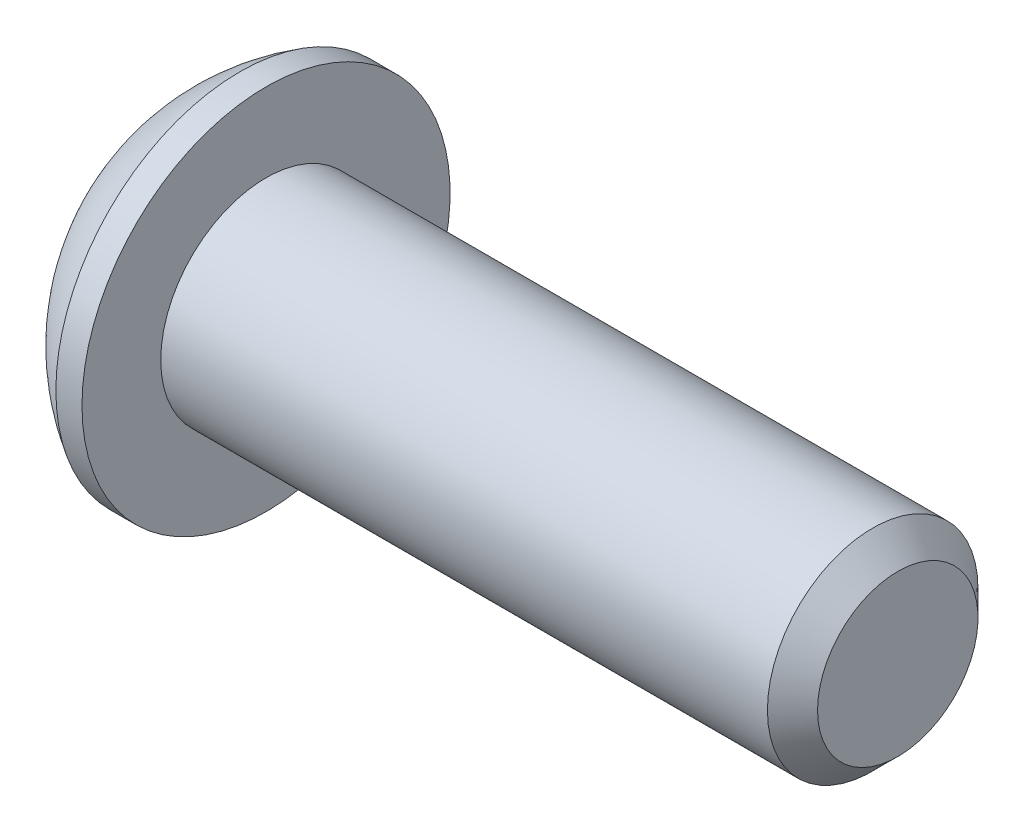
ISO-10303-21;
HEADER;
FILE_DESCRIPTION(('STEP AP214'),'2;1');
FILE_NAME('part.step','',(''),(''),'','','');
FILE_SCHEMA(('AUTOMOTIVE_DESIGN { 1 0 10303 214 1 1 1 1 }'));
ENDSEC;
DATA;
#1=APPLICATION_CONTEXT('core data for automotive mechanical design processes');
#2=APPLICATION_PROTOCOL_DEFINITION('international standard','automotive_design',2000,#1);
#3=PRODUCT_CONTEXT('',#1,'mechanical');
#4=PRODUCT('Part','Part','',(#3));
#5=PRODUCT_RELATED_PRODUCT_CATEGORY('part','',(#4));
#6=PRODUCT_DEFINITION_FORMATION('','',#4);
#7=PRODUCT_DEFINITION_CONTEXT('part definition',#1,'design');
#8=PRODUCT_DEFINITION('design','',#6,#7);
#9=PRODUCT_DEFINITION_SHAPE('','',#8);
#10=(LENGTH_UNIT() NAMED_UNIT(*) SI_UNIT(.MILLI.,.METRE.));
#11=(NAMED_UNIT(*) PLANE_ANGLE_UNIT() SI_UNIT($,.RADIAN.));
#12=(NAMED_UNIT(*) SI_UNIT($,.STERADIAN.) SOLID_ANGLE_UNIT());
#13=UNCERTAINTY_MEASURE_WITH_UNIT(LENGTH_MEASURE(1.E-05),#10,'distance_accuracy_value','');
#14=(GEOMETRIC_REPRESENTATION_CONTEXT(3) GLOBAL_UNCERTAINTY_ASSIGNED_CONTEXT((#13)) GLOBAL_UNIT_ASSIGNED_CONTEXT((#10,
#11,#12)) REPRESENTATION_CONTEXT('',''));
#15=CARTESIAN_POINT('',(0.,0.,0.));
#16=DIRECTION('',(0.,0.,1.));
#17=DIRECTION('',(1.,0.,0.));
#18=AXIS2_PLACEMENT_3D('',#15,#16,#17);
#19=CARTESIAN_POINT('',(0.,0.,0.));
#20=DIRECTION('',(-1.,0.,0.));
#21=DIRECTION('',(0.,0.,1.));
#22=AXIS2_PLACEMENT_3D('',#19,#20,#21);
#23=PLANE('',#22);
#24=CARTESIAN_POINT('',(0.,0.,0.));
#25=DIRECTION('',(-1.,0.,0.));
#26=DIRECTION('',(0.,0.,1.));
#27=AXIS2_PLACEMENT_3D('',#24,#25,#26);
#28=CIRCLE('',#27,2.77495);
#29=CARTESIAN_POINT('',(0.,2.77495,0.));
#30=VERTEX_POINT('',#29);
#31=EDGE_CURVE('E11',#30,#30,#28,.T.);
#32=ORIENTED_EDGE('',*,*,#31,.T.);
#33=EDGE_LOOP('',(#32));
#34=FACE_BOUND('',#33,.T.);
#35=DIRECTION('',(0.,-1.,0.));
#36=VECTOR('',#35,1.);
#37=CARTESIAN_POINT('',(0.,-1.14384635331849,1.9812));
#38=LINE('',#37,#36);
#39=CARTESIAN_POINT('',(0.,1.14384635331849,1.9812));
#40=VERTEX_POINT('',#39);
#41=CARTESIAN_POINT('',(0.,-1.14384635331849,1.9812));
#42=VERTEX_POINT('',#41);
#43=EDGE_CURVE('E46',#40,#42,#38,.T.);
#44=ORIENTED_EDGE('',*,*,#43,.T.);
#45=DIRECTION('',(0.,-0.5,-0.866025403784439));
#46=VECTOR('',#45,1.);
#47=CARTESIAN_POINT('',(0.,-2.28769270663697,0.));
#48=LINE('',#47,#46);
#49=CARTESIAN_POINT('',(0.,-2.28769270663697,0.));
#50=VERTEX_POINT('',#49);
#51=EDGE_CURVE('E362',#42,#50,#48,.T.);
#52=ORIENTED_EDGE('',*,*,#51,.T.);
#53=DIRECTION('',(0.,0.5,-0.866025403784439));
#54=VECTOR('',#53,1.);
#55=CARTESIAN_POINT('',(0.,-1.14384635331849,-1.9812));
#56=LINE('',#55,#54);
#57=CARTESIAN_POINT('',(0.,-1.14384635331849,-1.9812));
#58=VERTEX_POINT('',#57);
#59=EDGE_CURVE('E126',#50,#58,#56,.T.);
#60=ORIENTED_EDGE('',*,*,#59,.T.);
#61=DIRECTION('',(0.,1.,0.));
#62=VECTOR('',#61,1.);
#63=CARTESIAN_POINT('',(0.,1.14384635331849,-1.9812));
#64=LINE('',#63,#62);
#65=CARTESIAN_POINT('',(0.,1.14384635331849,-1.9812));
#66=VERTEX_POINT('',#65);
#67=EDGE_CURVE('E365',#58,#66,#64,.T.);
#68=ORIENTED_EDGE('',*,*,#67,.T.);
#69=DIRECTION('',(0.,0.5,0.866025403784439));
#70=VECTOR('',#69,1.);
#71=CARTESIAN_POINT('',(0.,2.28769270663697,0.));
#72=LINE('',#71,#70);
#73=CARTESIAN_POINT('',(0.,2.28769270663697,0.));
#74=VERTEX_POINT('',#73);
#75=EDGE_CURVE('E367',#66,#74,#72,.T.);
#76=ORIENTED_EDGE('',*,*,#75,.T.);
#77=DIRECTION('',(0.,-0.5,0.866025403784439));
#78=VECTOR('',#77,1.);
#79=CARTESIAN_POINT('',(0.,1.14384635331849,1.9812));
#80=LINE('',#79,#78);
#81=EDGE_CURVE('E369',#74,#40,#80,.T.);
#82=ORIENTED_EDGE('',*,*,#81,.T.);
#83=EDGE_LOOP('',(#44,#52,#60,#68,#76,#82));
#84=FACE_BOUND('',#83,.T.);
#85=ADVANCED_FACE('F32',(#34,#84),#23,.T.);
#86=CARTESIAN_POINT('',(5.78512506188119,0.,0.));
#87=DIRECTION('',(-1.,0.,0.));
#88=DIRECTION('',(0.,1.,0.));
#89=AXIS2_PLACEMENT_3D('',#86,#87,#88);
#90=SPHERICAL_SURFACE('',#89,6.41623094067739);
#91=CARTESIAN_POINT('',(2.5654,0.,0.));
#92=DIRECTION('',(-1.,0.,0.));
#93=DIRECTION('',(0.,0.,1.));
#94=AXIS2_PLACEMENT_3D('',#91,#92,#93);
#95=CIRCLE('',#94,5.5499);
#96=CARTESIAN_POINT('',(2.5654,5.5499,0.));
#97=VERTEX_POINT('',#96);
#98=EDGE_CURVE('E39',#97,#97,#95,.T.);
#99=CARTESIAN_POINT('',(2.5654,5.5499,0.));
#100=CARTESIAN_POINT('',(2.53083708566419,5.52984868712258,0.));
#101=CARTESIAN_POINT('',(2.49646152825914,5.50947442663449,0.));
#102=CARTESIAN_POINT('',(2.42809701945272,5.4680872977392,0.));
#103=CARTESIAN_POINT('',(2.39410806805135,5.447074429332,0.));
#104=CARTESIAN_POINT('',(2.32652866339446,5.40441737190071,0.));
#105=CARTESIAN_POINT('',(2.29293821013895,5.38277318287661,0.));
#106=CARTESIAN_POINT('',(2.22616751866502,5.33886105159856,0.));
#107=CARTESIAN_POINT('',(2.19298728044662,5.3165931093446,0.));
#108=CARTESIAN_POINT('',(2.12704860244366,5.27144124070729,0.));
#109=CARTESIAN_POINT('',(2.09429016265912,5.24855731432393,0.));
#110=CARTESIAN_POINT('',(2.02920651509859,5.20218146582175,0.));
#111=CARTESIAN_POINT('',(1.99688130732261,5.17868954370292,0.));
#112=CARTESIAN_POINT('',(1.93267540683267,5.13110590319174,0.));
#113=CARTESIAN_POINT('',(1.90079471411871,5.10701418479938,0.));
#114=CARTESIAN_POINT('',(1.83748897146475,5.05823936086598,0.));
#115=CARTESIAN_POINT('',(1.80606392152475,5.03355625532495,0.));
#116=CARTESIAN_POINT('',(1.74368043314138,4.98360727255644,0.));
#117=CARTESIAN_POINT('',(1.71272199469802,4.95834139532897,0.));
#118=CARTESIAN_POINT('',(1.65128253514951,4.90723568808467,0.));
#119=CARTESIAN_POINT('',(1.62080151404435,4.88139585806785,0.));
#120=CARTESIAN_POINT('',(1.56032752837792,4.82915126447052,0.));
#121=CARTESIAN_POINT('',(1.53033456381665,4.80274650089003,0.));
#122=CARTESIAN_POINT('',(1.4708471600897,4.74938125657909,0.));
#123=CARTESIAN_POINT('',(1.44135272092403,4.72242077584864,0.));
#124=CARTESIAN_POINT('',(1.38287266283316,4.66795350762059,0.));
#125=CARTESIAN_POINT('',(1.35388704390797,4.64044672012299,0.));
#126=CARTESIAN_POINT('',(1.29643474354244,4.58489643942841,0.));
#127=CARTESIAN_POINT('',(1.26796806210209,4.55685294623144,0.));
#128=CARTESIAN_POINT('',(1.21156357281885,4.50023904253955,0.));
#129=CARTESIAN_POINT('',(1.18362576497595,4.47166863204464,0.));
#130=CARTESIAN_POINT('',(1.12828877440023,4.41401086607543,0.));
#131=CARTESIAN_POINT('',(1.10088959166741,4.38492351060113,0.));
#132=CARTESIAN_POINT('',(1.04663941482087,4.32624200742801,0.));
#133=CARTESIAN_POINT('',(1.01978842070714,4.2966478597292,0.));
#134=CARTESIAN_POINT('',(0.966643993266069,4.2369631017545,0.));
#135=CARTESIAN_POINT('',(0.94035055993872,4.20687249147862,0.));
#136=CARTESIAN_POINT('',(0.888330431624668,4.14620531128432,0.));
#137=CARTESIAN_POINT('',(0.862603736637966,4.11562874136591,0.));
#138=CARTESIAN_POINT('',(0.811726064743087,4.05400031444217,0.));
#139=CARTESIAN_POINT('',(0.786575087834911,4.02294845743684,0.));
#140=CARTESIAN_POINT('',(0.736857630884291,3.96038029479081,0.));
#141=CARTESIAN_POINT('',(0.712291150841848,3.9288639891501,0.));
#142=CARTESIAN_POINT('',(0.6637512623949,3.8653779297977,0.));
#143=CARTESIAN_POINT('',(0.639777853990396,3.833408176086,0.));
#144=CARTESIAN_POINT('',(0.592432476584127,3.76902637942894,0.));
#145=CARTESIAN_POINT('',(0.569060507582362,3.73661433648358,0.));
#146=CARTESIAN_POINT('',(0.522926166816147,3.67135927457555,0.));
#147=CARTESIAN_POINT('',(0.500163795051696,3.63851625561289,0.));
#148=CARTESIAN_POINT('',(0.455256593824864,3.57241070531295,0.));
#149=CARTESIAN_POINT('',(0.433111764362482,3.53914817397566,0.));
#150=CARTESIAN_POINT('',(0.389447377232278,3.47221520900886,0.));
#151=CARTESIAN_POINT('',(0.367927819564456,3.43854477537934,0.));
#152=CARTESIAN_POINT('',(0.325521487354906,3.37080775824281,0.));
#153=CARTESIAN_POINT('',(0.304634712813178,3.3367411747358,0.));
#154=CARTESIAN_POINT('',(0.263501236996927,3.26822374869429,0.));
#155=CARTESIAN_POINT('',(0.243254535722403,3.23377290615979,0.));
#156=CARTESIAN_POINT('',(0.203408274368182,3.16449898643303,0.));
#157=CARTESIAN_POINT('',(0.183808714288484,3.12967590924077,0.));
#158=CARTESIAN_POINT('',(0.14526357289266,3.05966967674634,0.));
#159=CARTESIAN_POINT('',(0.126317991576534,3.02448652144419,0.));
#160=CARTESIAN_POINT('',(0.089087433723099,2.95377240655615,0.));
#161=CARTESIAN_POINT('',(0.0708024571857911,2.91824144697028,0.));
#162=CARTESIAN_POINT('',(0.0348994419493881,2.84684415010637,0.));
#163=CARTESIAN_POINT('',(0.017281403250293,2.81097781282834,0.));
#164=CARTESIAN_POINT('',(0.,2.77495,0.));
#165=B_SPLINE_CURVE_WITH_KNOTS('',3,(#99,#100,#101,#102,#103,#104,#105,#106,#107,#108,#109,#110,
#111,#112,#113,#114,#115,#116,#117,#118,#119,#120,#121,#122,#123,#124,#125,#126,#127,#128,#129,
#130,#131,#132,#133,#134,#135,#136,#137,#138,#139,#140,#141,#142,#143,#144,#145,#146,#147,#148,
#149,#150,#151,#152,#153,#154,#155,#156,#157,#158,#159,#160,#161,#162,#163,#164),.UNSPECIFIED.,
.F.,.F.,(4,2,2,2,2,2,2,2,2,2,2,2,2,2,2,2,2,2,2,2,2,2,2,2,2,2,2,2,2,2,2,2,4),(0.,
0.119872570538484,0.239745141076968,0.359617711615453,0.479490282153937,0.599362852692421,
0.719235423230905,0.83910799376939,0.958980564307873,1.07885313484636,1.19872570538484,
1.31859827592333,1.43847084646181,1.55834341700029,1.67821598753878,1.79808855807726,
1.91796112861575,2.03783369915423,2.15770626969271,2.2775788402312,2.39745141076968,
2.51732398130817,2.63719655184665,2.75706912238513,2.87694169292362,2.9968142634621,
3.11668683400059,3.23655940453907,3.35643197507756,3.47630454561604,3.59617711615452,
3.71604968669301,3.83592225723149),.UNSPECIFIED.);
#166=EDGE_CURVE('BSEAM153',#97,#30,#165,.T.);
#167=ORIENTED_EDGE('',*,*,#98,.T.);
#168=ORIENTED_EDGE('',*,*,#31,.F.);
#169=ORIENTED_EDGE('',*,*,#166,.T.);
#170=ORIENTED_EDGE('',*,*,#166,.F.);
#171=EDGE_LOOP('',(#167,#169,#168,#170));
#172=FACE_BOUND('',#171,.T.);
#173=ADVANCED_FACE('F153',(#172),#90,.T.);
#174=CARTESIAN_POINT('',(0.,0.,0.));
#175=DIRECTION('',(-1.,0.,0.));
#176=DIRECTION('',(0.,0.,1.));
#177=AXIS2_PLACEMENT_3D('',#174,#175,#176);
#178=CYLINDRICAL_SURFACE('',#177,5.5499);
#179=ORIENTED_EDGE('',*,*,#98,.F.);
#180=EDGE_LOOP('',(#179));
#181=FACE_BOUND('',#180,.T.);
#182=CARTESIAN_POINT('',(3.3528,0.,0.));
#183=DIRECTION('',(-1.,0.,0.));
#184=DIRECTION('',(0.,0.,1.));
#185=AXIS2_PLACEMENT_3D('',#182,#183,#184);
#186=CIRCLE('',#185,5.5499);
#187=CARTESIAN_POINT('',(3.3528,0.,5.5499));
#188=VERTEX_POINT('',#187);
#189=EDGE_CURVE('E148',#188,#188,#186,.T.);
#190=ORIENTED_EDGE('',*,*,#189,.T.);
#191=EDGE_LOOP('',(#190));
#192=FACE_BOUND('',#191,.T.);
#193=ADVANCED_FACE('F156',(#181,#192),#178,.T.);
#194=CARTESIAN_POINT('',(3.3528,3.17499999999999,0.));
#195=DIRECTION('',(-1.,0.,0.));
#196=DIRECTION('',(0.,0.,1.));
#197=AXIS2_PLACEMENT_3D('',#194,#195,#196);
#198=PLANE('',#197);
#199=ORIENTED_EDGE('',*,*,#189,.F.);
#200=EDGE_LOOP('',(#199));
#201=FACE_BOUND('',#200,.T.);
#202=CARTESIAN_POINT('',(3.3528,0.,0.));
#203=DIRECTION('',(-1.,0.,0.));
#204=DIRECTION('',(0.,0.,1.));
#205=AXIS2_PLACEMENT_3D('',#202,#203,#204);
#206=CIRCLE('',#205,3.17499999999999);
#207=CARTESIAN_POINT('',(3.3528,0.,3.17499999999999));
#208=VERTEX_POINT('',#207);
#209=EDGE_CURVE('E145',#208,#208,#206,.T.);
#210=ORIENTED_EDGE('',*,*,#209,.T.);
#211=EDGE_LOOP('',(#210));
#212=FACE_BOUND('',#211,.T.);
#213=ADVANCED_FACE('F159',(#201,#212),#198,.F.);
#214=CARTESIAN_POINT('',(0.,0.,0.));
#215=DIRECTION('',(-1.,0.,0.));
#216=DIRECTION('',(0.,0.,1.));
#217=AXIS2_PLACEMENT_3D('',#214,#215,#216);
#218=CYLINDRICAL_SURFACE('',#217,3.175);
#219=ORIENTED_EDGE('',*,*,#209,.F.);
#220=EDGE_LOOP('',(#219));
#221=FACE_BOUND('',#220,.T.);
#222=CARTESIAN_POINT('',(21.64715,0.,0.));
#223=DIRECTION('',(-1.,0.,0.));
#224=DIRECTION('',(0.,0.,1.));
#225=AXIS2_PLACEMENT_3D('',#222,#223,#224);
#226=CIRCLE('',#225,3.175);
#227=CARTESIAN_POINT('',(21.64715,0.,3.175));
#228=VERTEX_POINT('',#227);
#229=EDGE_CURVE('E142',#228,#228,#226,.T.);
#230=ORIENTED_EDGE('',*,*,#229,.T.);
#231=EDGE_LOOP('',(#230));
#232=FACE_BOUND('',#231,.T.);
#233=ADVANCED_FACE('F165',(#221,#232),#218,.T.);
#234=CARTESIAN_POINT('',(22.4028,0.,0.));
#235=DIRECTION('',(-1.,0.,0.));
#236=DIRECTION('',(0.,0.,1.));
#237=AXIS2_PLACEMENT_3D('',#234,#235,#236);
#238=CONICAL_SURFACE('',#237,2.41935,0.785398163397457);
#239=ORIENTED_EDGE('',*,*,#229,.F.);
#240=EDGE_LOOP('',(#239));
#241=FACE_BOUND('',#240,.T.);
#242=CARTESIAN_POINT('',(22.4028,0.,0.));
#243=DIRECTION('',(-1.,0.,0.));
#244=DIRECTION('',(0.,0.,1.));
#245=AXIS2_PLACEMENT_3D('',#242,#243,#244);
#246=CIRCLE('',#245,2.41935);
#247=CARTESIAN_POINT('',(22.4028,0.,2.41935));
#248=VERTEX_POINT('',#247);
#249=EDGE_CURVE('E138',#248,#248,#246,.T.);
#250=ORIENTED_EDGE('',*,*,#249,.T.);
#251=EDGE_LOOP('',(#250));
#252=FACE_BOUND('',#251,.T.);
#253=ADVANCED_FACE('F171',(#241,#252),#238,.T.);
#254=CARTESIAN_POINT('',(22.4028,0.,0.));
#255=DIRECTION('',(-1.,0.,0.));
#256=DIRECTION('',(0.,0.,1.));
#257=AXIS2_PLACEMENT_3D('',#254,#255,#256);
#258=PLANE('',#257);
#259=ORIENTED_EDGE('',*,*,#249,.F.);
#260=EDGE_LOOP('',(#259));
#261=FACE_BOUND('',#260,.T.);
#262=ADVANCED_FACE('F177',(#261),#258,.F.);
#263=CARTESIAN_POINT('',(2.2098,-2.28769270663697,0.));
#264=DIRECTION('',(0.,0.866025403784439,-0.5));
#265=DIRECTION('',(0.,0.5,0.866025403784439));
#266=AXIS2_PLACEMENT_3D('',#263,#264,#265);
#267=PLANE('',#266);
#268=DIRECTION('',(0.,-0.5,-0.866025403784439));
#269=VECTOR('',#268,1.);
#270=CARTESIAN_POINT('',(2.2098,-2.28769270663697,0.));
#271=LINE('',#270,#269);
#272=CARTESIAN_POINT('',(2.2098,-1.14384635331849,1.9812));
#273=VERTEX_POINT('',#272);
#274=CARTESIAN_POINT('',(2.2098,-1.71576952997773,0.9906));
#275=VERTEX_POINT('',#274);
#276=EDGE_CURVE('E112',#273,#275,#271,.T.);
#277=ORIENTED_EDGE('',*,*,#276,.T.);
#278=CARTESIAN_POINT('',(2.2098,-2.28769270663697,0.));
#279=VERTEX_POINT('',#278);
#280=EDGE_CURVE('E107',#275,#279,#271,.T.);
#281=ORIENTED_EDGE('',*,*,#280,.T.);
#282=DIRECTION('',(-1.,0.,0.));
#283=VECTOR('',#282,1.);
#284=CARTESIAN_POINT('',(2.2098,-2.28769270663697,0.));
#285=LINE('',#284,#283);
#286=EDGE_CURVE('E109',#279,#50,#285,.T.);
#287=ORIENTED_EDGE('',*,*,#286,.T.);
#288=ORIENTED_EDGE('',*,*,#51,.F.);
#289=DIRECTION('',(-1.,0.,0.));
#290=VECTOR('',#289,1.);
#291=CARTESIAN_POINT('',(2.2098,-1.14384635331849,1.9812));
#292=LINE('',#291,#290);
#293=EDGE_CURVE('E357',#273,#42,#292,.T.);
#294=ORIENTED_EDGE('',*,*,#293,.F.);
#295=EDGE_LOOP('',(#277,#281,#287,#288,#294));
#296=FACE_BOUND('',#295,.T.);
#297=ADVANCED_FACE('F108',(#296),#267,.T.);
#298=CARTESIAN_POINT('',(2.2098,-1.14384635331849,-1.9812));
#299=DIRECTION('',(0.,0.866025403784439,0.5));
#300=DIRECTION('',(0.,-0.5,0.866025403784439));
#301=AXIS2_PLACEMENT_3D('',#298,#299,#300);
#302=PLANE('',#301);
#303=DIRECTION('',(0.,0.5,-0.866025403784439));
#304=VECTOR('',#303,1.);
#305=CARTESIAN_POINT('',(2.2098,-1.14384635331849,-1.9812));
#306=LINE('',#305,#304);
#307=CARTESIAN_POINT('',(2.2098,-1.71576952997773,-0.9906));
#308=VERTEX_POINT('',#307);
#309=EDGE_CURVE('E54',#279,#308,#306,.T.);
#310=ORIENTED_EDGE('',*,*,#309,.T.);
#311=CARTESIAN_POINT('',(2.2098,-1.14384635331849,-1.9812));
#312=VERTEX_POINT('',#311);
#313=EDGE_CURVE('E121',#308,#312,#306,.T.);
#314=ORIENTED_EDGE('',*,*,#313,.T.);
#315=DIRECTION('',(-1.,0.,0.));
#316=VECTOR('',#315,1.);
#317=CARTESIAN_POINT('',(2.2098,-1.14384635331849,-1.9812));
#318=LINE('',#317,#316);
#319=EDGE_CURVE('E128',#312,#58,#318,.T.);
#320=ORIENTED_EDGE('',*,*,#319,.T.);
#321=ORIENTED_EDGE('',*,*,#59,.F.);
#322=ORIENTED_EDGE('',*,*,#286,.F.);
#323=EDGE_LOOP('',(#310,#314,#320,#321,#322));
#324=FACE_BOUND('',#323,.T.);
#325=ADVANCED_FACE('F124',(#324),#302,.T.);
#326=CARTESIAN_POINT('',(2.2098,1.14384635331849,-1.9812));
#327=DIRECTION('',(0.,0.,1.));
#328=DIRECTION('',(1.,0.,0.));
#329=AXIS2_PLACEMENT_3D('',#326,#327,#328);
#330=PLANE('',#329);
#331=DIRECTION('',(0.,1.,0.));
#332=VECTOR('',#331,1.);
#333=CARTESIAN_POINT('',(2.2098,1.14384635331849,-1.9812));
#334=LINE('',#333,#332);
#335=CARTESIAN_POINT('',(2.2098,0.,-1.9812));
#336=VERTEX_POINT('',#335);
#337=EDGE_CURVE('E387',#312,#336,#334,.T.);
#338=ORIENTED_EDGE('',*,*,#337,.T.);
#339=CARTESIAN_POINT('',(2.2098,1.14384635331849,-1.9812));
#340=VERTEX_POINT('',#339);
#341=EDGE_CURVE('E120',#336,#340,#334,.T.);
#342=ORIENTED_EDGE('',*,*,#341,.T.);
#343=DIRECTION('',(-1.,0.,0.));
#344=VECTOR('',#343,1.);
#345=CARTESIAN_POINT('',(2.2098,1.14384635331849,-1.9812));
#346=LINE('',#345,#344);
#347=EDGE_CURVE('E133',#340,#66,#346,.T.);
#348=ORIENTED_EDGE('',*,*,#347,.T.);
#349=ORIENTED_EDGE('',*,*,#67,.F.);
#350=ORIENTED_EDGE('',*,*,#319,.F.);
#351=EDGE_LOOP('',(#338,#342,#348,#349,#350));
#352=FACE_BOUND('',#351,.T.);
#353=ADVANCED_FACE('F236',(#352),#330,.T.);
#354=CARTESIAN_POINT('',(2.2098,2.28769270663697,0.));
#355=DIRECTION('',(0.,-0.866025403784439,0.5));
#356=DIRECTION('',(0.,-0.5,-0.866025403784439));
#357=AXIS2_PLACEMENT_3D('',#354,#355,#356);
#358=PLANE('',#357);
#359=DIRECTION('',(0.,0.5,0.866025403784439));
#360=VECTOR('',#359,1.);
#361=CARTESIAN_POINT('',(2.2098,2.28769270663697,0.));
#362=LINE('',#361,#360);
#363=CARTESIAN_POINT('',(2.2098,1.71576952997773,-0.990600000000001));
#364=VERTEX_POINT('',#363);
#365=EDGE_CURVE('E391',#340,#364,#362,.T.);
#366=ORIENTED_EDGE('',*,*,#365,.T.);
#367=CARTESIAN_POINT('',(2.2098,2.28769270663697,0.));
#368=VERTEX_POINT('',#367);
#369=EDGE_CURVE('E389',#364,#368,#362,.T.);
#370=ORIENTED_EDGE('',*,*,#369,.T.);
#371=DIRECTION('',(-1.,0.,0.));
#372=VECTOR('',#371,1.);
#373=CARTESIAN_POINT('',(2.2098,2.28769270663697,0.));
#374=LINE('',#373,#372);
#375=EDGE_CURVE('E373',#368,#74,#374,.T.);
#376=ORIENTED_EDGE('',*,*,#375,.T.);
#377=ORIENTED_EDGE('',*,*,#75,.F.);
#378=ORIENTED_EDGE('',*,*,#347,.F.);
#379=EDGE_LOOP('',(#366,#370,#376,#377,#378));
#380=FACE_BOUND('',#379,.T.);
#381=ADVANCED_FACE('F245',(#380),#358,.T.);
#382=CARTESIAN_POINT('',(2.2098,1.14384635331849,1.9812));
#383=DIRECTION('',(0.,-0.866025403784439,-0.5));
#384=DIRECTION('',(0.,0.5,-0.866025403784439));
#385=AXIS2_PLACEMENT_3D('',#382,#383,#384);
#386=PLANE('',#385);
#387=DIRECTION('',(0.,-0.5,0.866025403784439));
#388=VECTOR('',#387,1.);
#389=CARTESIAN_POINT('',(2.2098,1.14384635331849,1.9812));
#390=LINE('',#389,#388);
#391=CARTESIAN_POINT('',(2.2098,1.71576952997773,0.990600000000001));
#392=VERTEX_POINT('',#391);
#393=EDGE_CURVE('E352',#368,#392,#390,.T.);
#394=ORIENTED_EDGE('',*,*,#393,.T.);
#395=CARTESIAN_POINT('',(2.2098,1.14384635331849,1.9812));
#396=VERTEX_POINT('',#395);
#397=EDGE_CURVE('E348',#392,#396,#390,.T.);
#398=ORIENTED_EDGE('',*,*,#397,.T.);
#399=DIRECTION('',(-1.,0.,0.));
#400=VECTOR('',#399,1.);
#401=CARTESIAN_POINT('',(2.2098,1.14384635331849,1.9812));
#402=LINE('',#401,#400);
#403=EDGE_CURVE('E356',#396,#40,#402,.T.);
#404=ORIENTED_EDGE('',*,*,#403,.T.);
#405=ORIENTED_EDGE('',*,*,#81,.F.);
#406=ORIENTED_EDGE('',*,*,#375,.F.);
#407=EDGE_LOOP('',(#394,#398,#404,#405,#406));
#408=FACE_BOUND('',#407,.T.);
#409=ADVANCED_FACE('F255',(#408),#386,.T.);
#410=CARTESIAN_POINT('',(2.2098,-1.14384635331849,1.9812));
#411=DIRECTION('',(0.,0.,-1.));
#412=DIRECTION('',(0.,1.,0.));
#413=AXIS2_PLACEMENT_3D('',#410,#411,#412);
#414=PLANE('',#413);
#415=DIRECTION('',(0.,-1.,0.));
#416=VECTOR('',#415,1.);
#417=CARTESIAN_POINT('',(2.2098,-1.14384635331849,1.9812));
#418=LINE('',#417,#416);
#419=CARTESIAN_POINT('',(2.2098,0.,1.9812));
#420=VERTEX_POINT('',#419);
#421=EDGE_CURVE('E347',#396,#420,#418,.T.);
#422=ORIENTED_EDGE('',*,*,#421,.T.);
#423=EDGE_CURVE('E350',#420,#273,#418,.T.);
#424=ORIENTED_EDGE('',*,*,#423,.T.);
#425=ORIENTED_EDGE('',*,*,#293,.T.);
#426=ORIENTED_EDGE('',*,*,#43,.F.);
#427=ORIENTED_EDGE('',*,*,#403,.F.);
#428=EDGE_LOOP('',(#422,#424,#425,#426,#427));
#429=FACE_BOUND('',#428,.T.);
#430=ADVANCED_FACE('F265',(#429),#414,.T.);
#431=CARTESIAN_POINT('',(2.2098,-2.28769270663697,0.));
#432=DIRECTION('',(1.,0.,0.));
#433=DIRECTION('',(0.,0.,-1.));
#434=AXIS2_PLACEMENT_3D('',#431,#432,#433);
#435=PLANE('',#434);
#436=CARTESIAN_POINT('',(2.2098,0.,0.));
#437=DIRECTION('',(-1.,0.,0.));
#438=DIRECTION('',(0.,0.,1.));
#439=AXIS2_PLACEMENT_3D('',#436,#437,#438);
#440=CIRCLE('',#439,1.9812);
#441=EDGE_CURVE('E394',#364,#336,#440,.T.);
#442=ORIENTED_EDGE('',*,*,#441,.F.);
#443=ORIENTED_EDGE('',*,*,#365,.F.);
#444=ORIENTED_EDGE('',*,*,#341,.F.);
#445=EDGE_LOOP('',(#442,#443,#444));
#446=FACE_BOUND('',#445,.T.);
#447=ADVANCED_FACE('F275',(#446),#435,.F.);
#448=EDGE_CURVE('E139',#392,#364,#440,.T.);
#449=ORIENTED_EDGE('',*,*,#448,.F.);
#450=ORIENTED_EDGE('',*,*,#393,.F.);
#451=ORIENTED_EDGE('',*,*,#369,.F.);
#452=EDGE_LOOP('',(#449,#450,#451));
#453=FACE_BOUND('',#452,.T.);
#454=ADVANCED_FACE('F285',(#453),#435,.F.);
#455=EDGE_CURVE('E132',#420,#392,#440,.T.);
#456=ORIENTED_EDGE('',*,*,#455,.F.);
#457=ORIENTED_EDGE('',*,*,#421,.F.);
#458=ORIENTED_EDGE('',*,*,#397,.F.);
#459=EDGE_LOOP('',(#456,#457,#458));
#460=FACE_BOUND('',#459,.T.);
#461=ADVANCED_FACE('F296',(#460),#435,.F.);
#462=EDGE_CURVE('E127',#275,#420,#440,.T.);
#463=ORIENTED_EDGE('',*,*,#462,.F.);
#464=ORIENTED_EDGE('',*,*,#276,.F.);
#465=ORIENTED_EDGE('',*,*,#423,.F.);
#466=EDGE_LOOP('',(#463,#464,#465));
#467=FACE_BOUND('',#466,.T.);
#468=ADVANCED_FACE('F305',(#467),#435,.F.);
#469=EDGE_CURVE('E118',#308,#275,#440,.T.);
#470=ORIENTED_EDGE('',*,*,#469,.F.);
#471=ORIENTED_EDGE('',*,*,#309,.F.);
#472=ORIENTED_EDGE('',*,*,#280,.F.);
#473=EDGE_LOOP('',(#470,#471,#472));
#474=FACE_BOUND('',#473,.T.);
#475=ADVANCED_FACE('F117',(#474),#435,.F.);
#476=EDGE_CURVE('E388',#336,#308,#440,.T.);
#477=ORIENTED_EDGE('',*,*,#476,.F.);
#478=ORIENTED_EDGE('',*,*,#337,.F.);
#479=ORIENTED_EDGE('',*,*,#313,.F.);
#480=EDGE_LOOP('',(#477,#478,#479));
#481=FACE_BOUND('',#480,.T.);
#482=ADVANCED_FACE('F288',(#481),#435,.F.);
#483=CARTESIAN_POINT('',(3.3536463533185,0.,0.));
#484=DIRECTION('',(-1.,0.,0.));
#485=DIRECTION('',(0.,0.,1.));
#486=AXIS2_PLACEMENT_3D('',#483,#484,#485);
#487=CONICAL_SURFACE('',#486,0.,1.04719755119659);
#488=ORIENTED_EDGE('',*,*,#455,.T.);
#489=ORIENTED_EDGE('',*,*,#448,.T.);
#490=ORIENTED_EDGE('',*,*,#441,.T.);
#491=ORIENTED_EDGE('',*,*,#476,.T.);
#492=ORIENTED_EDGE('',*,*,#469,.T.);
#493=ORIENTED_EDGE('',*,*,#462,.T.);
#494=EDGE_LOOP('',(#488,#489,#490,#491,#492,#493));
#495=FACE_BOUND('',#494,.T.);
#496=CARTESIAN_POINT('',(3.3536463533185,0.,0.));
#497=VERTEX_POINT('',#496);
#498=VERTEX_LOOP('',#497);
#499=FACE_BOUND('',#498,.T.);
#500=ADVANCED_FACE('F329',(#495,#499),#487,.F.);
#501=CLOSED_SHELL('',(#85,#173,#193,#213,#233,#253,#262,#297,#325,#353,#381,#409,#430,#447,#454,
#461,#468,#475,#482,#500));
#502=MANIFOLD_SOLID_BREP('B2',#501);
#503=ADVANCED_BREP_SHAPE_REPRESENTATION('',(#18,#502),#14);
#504=SHAPE_DEFINITION_REPRESENTATION(#9,#503);
ENDSEC;
END-ISO-10303-21;
